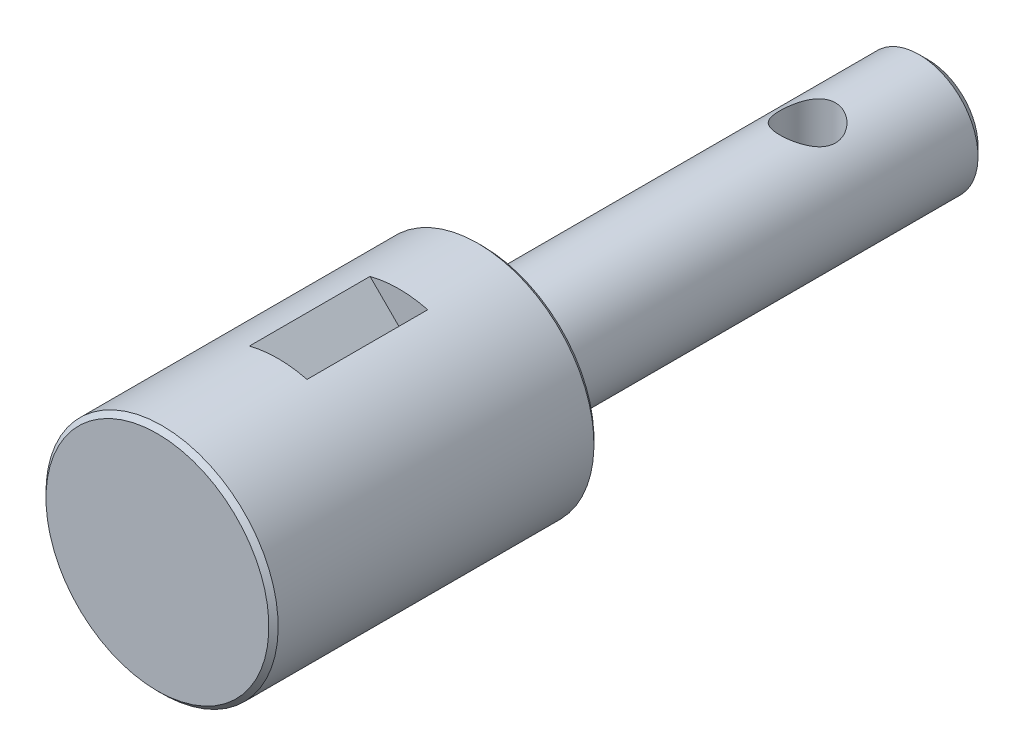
from build123d import *

# Parameters (mm, degrees)
CUT_EXTRUDE_1_DEPTH = 13
SKETCH_3_R          = 3
CUT_EXTRUDE_2_DEPTH = 10


with BuildPart() as part:
    # Sketch 1 → Revolve 1 (revolve)
    with BuildSketch(Plane(origin=(0, 0, 0), x_dir=(0, 0, -1), z_dir=(1, 0, 0))):
        Polygon((0, 0), (0, 12), (0.5, 12.5), (34.5, 12.5), (35, 12), (35, 6.35), (82, 6.35), (83, 5.35), (83, 0), align=None)
    revolve(axis=Axis((0, 0, -83), (0, 0, 1)))

    # Sketch 2 → Cut-Extrude 1 (cut)
    with BuildSketch(Plane.XY.offset(-13)):
        Polygon((-3.853397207, 12.853397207), (3.853397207, 12.853397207), (0, 9), align=None)
    extrude(amount=-CUT_EXTRUDE_1_DEPTH, mode=Mode.SUBTRACT)

    # Sketch 3 → Cut-Extrude 2 (cut, symmetric)
    with BuildSketch(Plane(origin=(0, 0, 0), x_dir=(1, 0, 0), z_dir=(0, 1, 0))):
        with Locations(Location((0, 70, 0), (0, 0, 270))):
            Circle(SKETCH_3_R)
    extrude(amount=CUT_EXTRUDE_2_DEPTH, both=True, mode=Mode.SUBTRACT)


solid = part.part
